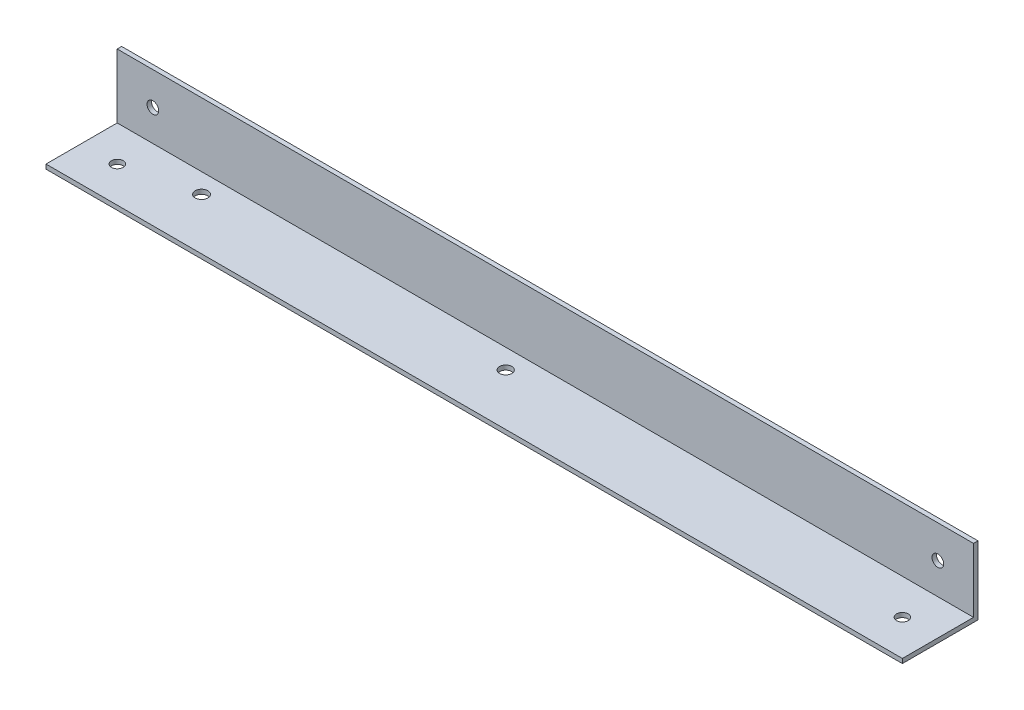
from build123d import *

# Parameters (mm, degrees)
SKETCH1_W           = 304.8
SKETCH1_H           = 24.384
BOSS_EXTRUDE1_DEPTH = 26.924
SKETCH2_W           = 304.8
SKETCH2_H           = 25.3365
CUT_EXTRUDE1_DEPTH  = 12.7
SKETCH3_W           = 304.8
SKETCH3_H           = 10.0965
CUT_EXTRUDE3_DEPTH  = 25.3365
SKETCH4_R           = 2.0828
CUT_EXTRUDE4_DEPTH  = 2.54
SKETCH5_R           = 2.0828
CUT_EXTRUDE5_DEPTH  = 2.54
SKETCH6_R           = 2.166149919
SKETCH6_R_2         = 2.25
CUT_EXTRUDE6_DEPTH  = 2.54


with BuildPart() as part:
    # Sketch1 → Boss-Extrude1 (new body)
    with BuildSketch(Plane.XY):
        with Locations((-57.426086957, 55.646509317)):
            Rectangle(SKETCH1_W, SKETCH1_H)
    extrude(amount=BOSS_EXTRUDE1_DEPTH)

    # Sketch2 → Cut-Extrude1 (cut)
    with BuildSketch(Plane(origin=(0, 67.838509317, 0), x_dir=(1, 0, 0), z_dir=(0, 1, 0))):
        with Locations((-57.426086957, -14.25575)):
            Rectangle(SKETCH2_W, SKETCH2_H)
    extrude(amount=-CUT_EXTRUDE1_DEPTH, mode=Mode.SUBTRACT)

    # Sketch3 → Cut-Extrude3 (cut)
    with BuildSketch(Plane.XY.offset(26.924)):
        with Locations((-57.426086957, 50.090259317)):
            Rectangle(SKETCH3_W, SKETCH3_H)
    extrude(amount=-CUT_EXTRUDE3_DEPTH, mode=Mode.SUBTRACT)

    # Sketch4 → Cut-Extrude4 (cut)
    with BuildSketch(Plane(origin=(0, 0, 0), x_dir=(-1, 0, 0), z_dir=(0, 0, -1))):
        with Locations((-82.273913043, 56.154509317)):
            Circle(SKETCH4_R)
        with Locations((197.126086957, 56.154509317)):
            Circle(SKETCH4_R)
    extrude(amount=-CUT_EXTRUDE4_DEPTH, mode=Mode.SUBTRACT)

    # Sketch5 → Cut-Extrude5 (cut)
    with BuildSketch(Plane.XZ.offset(-43.454509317)):
        with Locations(Location((-197.126086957, 14.224, 0), (0, 0, 270))):
            Circle(SKETCH5_R)
        with Locations(Location((82.273913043, 14.224, 0), (0, 0, 270))):
            Circle(SKETCH5_R)
    extrude(amount=-CUT_EXTRUDE5_DEPTH, mode=Mode.SUBTRACT)

    # Sketch6 → Cut-Extrude6 (cut)
    with BuildSketch(Plane(origin=(0, 45.042009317, 0), x_dir=(1, 0, 0), z_dir=(0, 1, 0))):
        with Locations(Location((-64.533950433, -8.5875, 0), (0, 0, 270))):
            Circle(SKETCH6_R)
        with Locations(Location((-172.801475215, -8.5875, 0), (0, 0, 270))):
            Circle(SKETCH6_R_2)
    extrude(amount=-CUT_EXTRUDE6_DEPTH, mode=Mode.SUBTRACT)


solid = part.part
